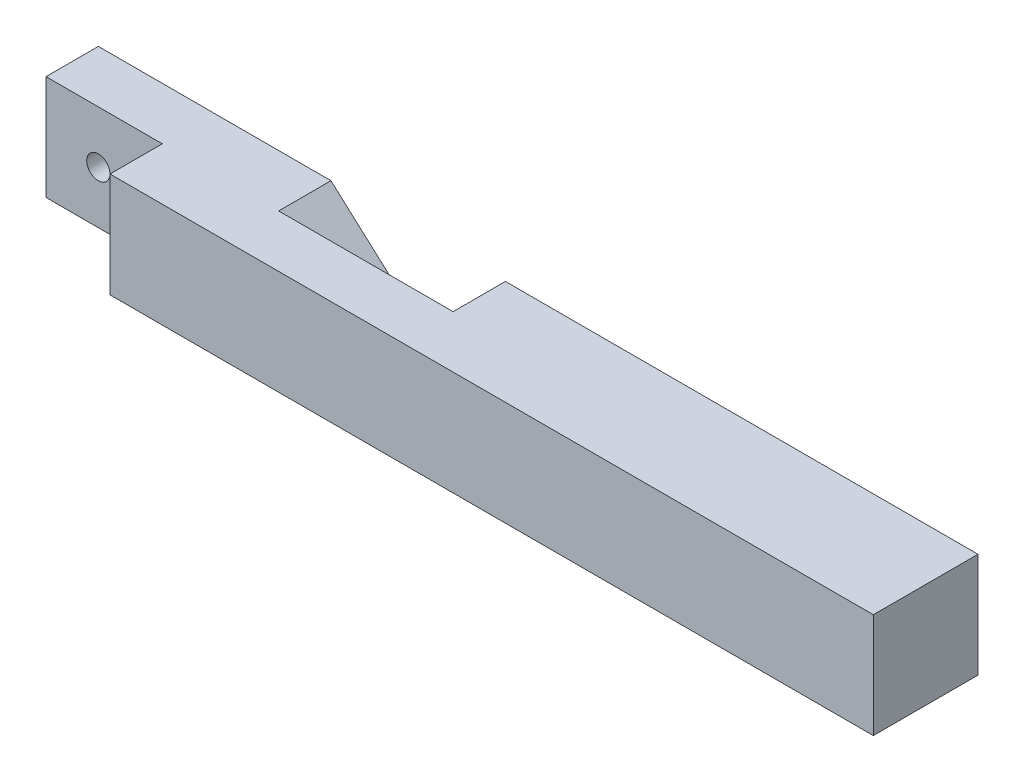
ISO-10303-21;
HEADER;
FILE_DESCRIPTION(('STEP AP214'),'2;1');
FILE_NAME('part.step','',(''),(''),'','','');
FILE_SCHEMA(('AUTOMOTIVE_DESIGN { 1 0 10303 214 1 1 1 1 }'));
ENDSEC;
DATA;
#1=APPLICATION_CONTEXT('core data for automotive mechanical design processes');
#2=APPLICATION_PROTOCOL_DEFINITION('international standard','automotive_design',2000,#1);
#3=PRODUCT_CONTEXT('',#1,'mechanical');
#4=PRODUCT('Part','Part','',(#3));
#5=PRODUCT_RELATED_PRODUCT_CATEGORY('part','',(#4));
#6=PRODUCT_DEFINITION_FORMATION('','',#4);
#7=PRODUCT_DEFINITION_CONTEXT('part definition',#1,'design');
#8=PRODUCT_DEFINITION('design','',#6,#7);
#9=PRODUCT_DEFINITION_SHAPE('','',#8);
#10=(LENGTH_UNIT() NAMED_UNIT(*) SI_UNIT(.MILLI.,.METRE.));
#11=(NAMED_UNIT(*) PLANE_ANGLE_UNIT() SI_UNIT($,.RADIAN.));
#12=(NAMED_UNIT(*) SI_UNIT($,.STERADIAN.) SOLID_ANGLE_UNIT());
#13=UNCERTAINTY_MEASURE_WITH_UNIT(LENGTH_MEASURE(1.E-05),#10,'distance_accuracy_value','');
#14=(GEOMETRIC_REPRESENTATION_CONTEXT(3) GLOBAL_UNCERTAINTY_ASSIGNED_CONTEXT((#13)) GLOBAL_UNIT_ASSIGNED_CONTEXT((#10,
#11,#12)) REPRESENTATION_CONTEXT('',''));
#15=CARTESIAN_POINT('',(0.,0.,0.));
#16=DIRECTION('',(0.,0.,1.));
#17=DIRECTION('',(1.,0.,0.));
#18=AXIS2_PLACEMENT_3D('',#15,#16,#17);
#19=CARTESIAN_POINT('',(0.,9.,0.));
#20=DIRECTION('',(0.,0.,-1.));
#21=DIRECTION('',(-1.,0.,0.));
#22=AXIS2_PLACEMENT_3D('',#19,#20,#21);
#23=PLANE('',#22);
#24=DIRECTION('',(-0.743294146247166,-0.66896473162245,0.));
#25=VECTOR('',#24,1.);
#26=CARTESIAN_POINT('',(35.,0.,0.));
#27=LINE('',#26,#25);
#28=CARTESIAN_POINT('',(40.,4.5,0.));
#29=VERTEX_POINT('',#28);
#30=CARTESIAN_POINT('',(35.,0.,0.));
#31=VERTEX_POINT('',#30);
#32=EDGE_CURVE('E140',#29,#31,#27,.T.);
#33=ORIENTED_EDGE('',*,*,#32,.F.);
#34=DIRECTION('',(0.743294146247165,-0.668964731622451,0.));
#35=VECTOR('',#34,1.);
#36=CARTESIAN_POINT('',(40.,4.5,0.));
#37=LINE('',#36,#35);
#38=CARTESIAN_POINT('',(35.,9.,0.));
#39=VERTEX_POINT('',#38);
#40=EDGE_CURVE('E142',#39,#29,#37,.T.);
#41=ORIENTED_EDGE('',*,*,#40,.F.);
#42=DIRECTION('',(-1.,0.,0.));
#43=VECTOR('',#42,1.);
#44=CARTESIAN_POINT('',(0.,9.,0.));
#45=LINE('',#44,#43);
#46=CARTESIAN_POINT('',(75.63,9.,0.));
#47=VERTEX_POINT('',#46);
#48=EDGE_CURVE('E193',#47,#39,#45,.T.);
#49=ORIENTED_EDGE('',*,*,#48,.F.);
#50=DIRECTION('',(0.,1.,0.));
#51=VECTOR('',#50,1.);
#52=CARTESIAN_POINT('',(75.63,0.,0.));
#53=LINE('',#52,#51);
#54=CARTESIAN_POINT('',(75.63,0.,0.));
#55=VERTEX_POINT('',#54);
#56=EDGE_CURVE('E205',#55,#47,#53,.T.);
#57=ORIENTED_EDGE('',*,*,#56,.F.);
#58=DIRECTION('',(1.,0.,0.));
#59=VECTOR('',#58,1.);
#60=CARTESIAN_POINT('',(0.,0.,0.));
#61=LINE('',#60,#59);
#62=EDGE_CURVE('E201',#31,#55,#61,.T.);
#63=ORIENTED_EDGE('',*,*,#62,.F.);
#64=EDGE_LOOP('',(#33,#41,#49,#57,#63));
#65=FACE_BOUND('',#64,.T.);
#66=ADVANCED_FACE('F31',(#65),#23,.T.);
#67=CARTESIAN_POINT('',(0.,0.,9.));
#68=DIRECTION('',(1.,0.,0.));
#69=DIRECTION('',(0.,0.,-1.));
#70=AXIS2_PLACEMENT_3D('',#67,#68,#69);
#71=PLANE('',#70);
#72=DIRECTION('',(0.,-1.,0.));
#73=VECTOR('',#72,1.);
#74=CARTESIAN_POINT('',(0.,9.,4.5));
#75=LINE('',#74,#73);
#76=CARTESIAN_POINT('',(0.,9.,4.5));
#77=VERTEX_POINT('',#76);
#78=CARTESIAN_POINT('',(0.,0.,4.5));
#79=VERTEX_POINT('',#78);
#80=EDGE_CURVE('E174',#77,#79,#75,.T.);
#81=ORIENTED_EDGE('',*,*,#80,.F.);
#82=DIRECTION('',(0.,0.,-1.));
#83=VECTOR('',#82,1.);
#84=CARTESIAN_POINT('',(0.,9.,9.));
#85=LINE('',#84,#83);
#86=CARTESIAN_POINT('',(0.,9.,0.));
#87=VERTEX_POINT('',#86);
#88=EDGE_CURVE('E198',#77,#87,#85,.T.);
#89=ORIENTED_EDGE('',*,*,#88,.T.);
#90=DIRECTION('',(0.,-1.,0.));
#91=VECTOR('',#90,1.);
#92=CARTESIAN_POINT('',(0.,0.,0.));
#93=LINE('',#92,#91);
#94=CARTESIAN_POINT('',(0.,0.,0.));
#95=VERTEX_POINT('',#94);
#96=EDGE_CURVE('E188',#87,#95,#93,.T.);
#97=ORIENTED_EDGE('',*,*,#96,.T.);
#98=DIRECTION('',(0.,0.,-1.));
#99=VECTOR('',#98,1.);
#100=CARTESIAN_POINT('',(0.,0.,9.));
#101=LINE('',#100,#99);
#102=EDGE_CURVE('E11',#79,#95,#101,.T.);
#103=ORIENTED_EDGE('',*,*,#102,.F.);
#104=EDGE_LOOP('',(#81,#89,#97,#103));
#105=FACE_BOUND('',#104,.T.);
#106=ADVANCED_FACE('F33',(#105),#71,.F.);
#107=CARTESIAN_POINT('',(0.,0.,9.));
#108=DIRECTION('',(0.,1.,0.));
#109=DIRECTION('',(0.,0.,1.));
#110=AXIS2_PLACEMENT_3D('',#107,#108,#109);
#111=PLANE('',#110);
#112=CARTESIAN_POINT('',(20.,0.,0.));
#113=VERTEX_POINT('',#112);
#114=EDGE_CURVE('E202',#95,#113,#61,.T.);
#115=ORIENTED_EDGE('',*,*,#114,.T.);
#116=DIRECTION('',(0.,0.,-1.));
#117=VECTOR('',#116,1.);
#118=CARTESIAN_POINT('',(20.,0.,4.5));
#119=LINE('',#118,#117);
#120=CARTESIAN_POINT('',(20.,0.,4.5));
#121=VERTEX_POINT('',#120);
#122=EDGE_CURVE('E157',#121,#113,#119,.T.);
#123=ORIENTED_EDGE('',*,*,#122,.F.);
#124=DIRECTION('',(-1.,0.,0.));
#125=VECTOR('',#124,1.);
#126=CARTESIAN_POINT('',(20.,0.,4.5));
#127=LINE('',#126,#125);
#128=CARTESIAN_POINT('',(35.,0.,4.5));
#129=VERTEX_POINT('',#128);
#130=EDGE_CURVE('E125',#129,#121,#127,.T.);
#131=ORIENTED_EDGE('',*,*,#130,.F.);
#132=DIRECTION('',(0.,0.,-1.));
#133=VECTOR('',#132,1.);
#134=CARTESIAN_POINT('',(35.,0.,4.5));
#135=LINE('',#134,#133);
#136=EDGE_CURVE('E160',#129,#31,#135,.T.);
#137=ORIENTED_EDGE('',*,*,#136,.T.);
#138=ORIENTED_EDGE('',*,*,#62,.T.);
#139=DIRECTION('',(0.,0.,-1.));
#140=VECTOR('',#139,1.);
#141=CARTESIAN_POINT('',(75.63,0.,9.));
#142=LINE('',#141,#140);
#143=CARTESIAN_POINT('',(75.63,0.,9.));
#144=VERTEX_POINT('',#143);
#145=EDGE_CURVE('E39',#144,#55,#142,.T.);
#146=ORIENTED_EDGE('',*,*,#145,.F.);
#147=DIRECTION('',(1.,0.,0.));
#148=VECTOR('',#147,1.);
#149=CARTESIAN_POINT('',(0.,0.,9.));
#150=LINE('',#149,#148);
#151=CARTESIAN_POINT('',(10.,0.,9.));
#152=VERTEX_POINT('',#151);
#153=EDGE_CURVE('E190',#152,#144,#150,.T.);
#154=ORIENTED_EDGE('',*,*,#153,.F.);
#155=DIRECTION('',(0.,0.,1.));
#156=VECTOR('',#155,1.);
#157=CARTESIAN_POINT('',(10.,0.,4.5));
#158=LINE('',#157,#156);
#159=CARTESIAN_POINT('',(10.,0.,4.5));
#160=VERTEX_POINT('',#159);
#161=EDGE_CURVE('E54',#160,#152,#158,.T.);
#162=ORIENTED_EDGE('',*,*,#161,.F.);
#163=DIRECTION('',(1.,0.,0.));
#164=VECTOR('',#163,1.);
#165=CARTESIAN_POINT('',(0.,0.,4.5));
#166=LINE('',#165,#164);
#167=EDGE_CURVE('E176',#79,#160,#166,.T.);
#168=ORIENTED_EDGE('',*,*,#167,.F.);
#169=ORIENTED_EDGE('',*,*,#102,.T.);
#170=EDGE_LOOP('',(#115,#123,#131,#137,#138,#146,#154,#162,#168,#169));
#171=FACE_BOUND('',#170,.T.);
#172=ADVANCED_FACE('F235',(#171),#111,.F.);
#173=CARTESIAN_POINT('',(75.63,0.,9.));
#174=DIRECTION('',(-1.,0.,0.));
#175=DIRECTION('',(0.,0.,1.));
#176=AXIS2_PLACEMENT_3D('',#173,#174,#175);
#177=PLANE('',#176);
#178=ORIENTED_EDGE('',*,*,#56,.T.);
#179=DIRECTION('',(0.,0.,-1.));
#180=VECTOR('',#179,1.);
#181=CARTESIAN_POINT('',(75.63,9.,9.));
#182=LINE('',#181,#180);
#183=CARTESIAN_POINT('',(75.63,9.,9.));
#184=VERTEX_POINT('',#183);
#185=EDGE_CURVE('E212',#184,#47,#182,.T.);
#186=ORIENTED_EDGE('',*,*,#185,.F.);
#187=DIRECTION('',(0.,1.,0.));
#188=VECTOR('',#187,1.);
#189=CARTESIAN_POINT('',(75.63,0.,9.));
#190=LINE('',#189,#188);
#191=EDGE_CURVE('E192',#144,#184,#190,.T.);
#192=ORIENTED_EDGE('',*,*,#191,.F.);
#193=ORIENTED_EDGE('',*,*,#145,.T.);
#194=EDGE_LOOP('',(#178,#186,#192,#193));
#195=FACE_BOUND('',#194,.T.);
#196=ADVANCED_FACE('F219',(#195),#177,.F.);
#197=CARTESIAN_POINT('',(0.,9.,9.));
#198=DIRECTION('',(0.,-1.,0.));
#199=DIRECTION('',(0.,0.,-1.));
#200=AXIS2_PLACEMENT_3D('',#197,#198,#199);
#201=PLANE('',#200);
#202=ORIENTED_EDGE('',*,*,#48,.T.);
#203=DIRECTION('',(0.,0.,-1.));
#204=VECTOR('',#203,1.);
#205=CARTESIAN_POINT('',(35.,9.,4.5));
#206=LINE('',#205,#204);
#207=CARTESIAN_POINT('',(35.,9.,4.5));
#208=VERTEX_POINT('',#207);
#209=EDGE_CURVE('E165',#208,#39,#206,.T.);
#210=ORIENTED_EDGE('',*,*,#209,.F.);
#211=DIRECTION('',(1.,0.,0.));
#212=VECTOR('',#211,1.);
#213=CARTESIAN_POINT('',(35.,9.,4.5));
#214=LINE('',#213,#212);
#215=CARTESIAN_POINT('',(20.,9.,4.5));
#216=VERTEX_POINT('',#215);
#217=EDGE_CURVE('E134',#216,#208,#214,.T.);
#218=ORIENTED_EDGE('',*,*,#217,.F.);
#219=DIRECTION('',(0.,0.,-1.));
#220=VECTOR('',#219,1.);
#221=CARTESIAN_POINT('',(20.,9.,4.5));
#222=LINE('',#221,#220);
#223=CARTESIAN_POINT('',(20.,9.,0.));
#224=VERTEX_POINT('',#223);
#225=EDGE_CURVE('E124',#216,#224,#222,.T.);
#226=ORIENTED_EDGE('',*,*,#225,.T.);
#227=EDGE_CURVE('E207',#224,#87,#45,.T.);
#228=ORIENTED_EDGE('',*,*,#227,.T.);
#229=ORIENTED_EDGE('',*,*,#88,.F.);
#230=DIRECTION('',(-1.,0.,0.));
#231=VECTOR('',#230,1.);
#232=CARTESIAN_POINT('',(0.,9.,4.5));
#233=LINE('',#232,#231);
#234=CARTESIAN_POINT('',(10.,9.,4.5));
#235=VERTEX_POINT('',#234);
#236=EDGE_CURVE('E182',#235,#77,#233,.T.);
#237=ORIENTED_EDGE('',*,*,#236,.F.);
#238=DIRECTION('',(0.,0.,1.));
#239=VECTOR('',#238,1.);
#240=CARTESIAN_POINT('',(10.,9.,4.5));
#241=LINE('',#240,#239);
#242=CARTESIAN_POINT('',(10.,9.,9.));
#243=VERTEX_POINT('',#242);
#244=EDGE_CURVE('E185',#235,#243,#241,.T.);
#245=ORIENTED_EDGE('',*,*,#244,.T.);
#246=DIRECTION('',(-1.,0.,0.));
#247=VECTOR('',#246,1.);
#248=CARTESIAN_POINT('',(0.,9.,9.));
#249=LINE('',#248,#247);
#250=EDGE_CURVE('E195',#184,#243,#249,.T.);
#251=ORIENTED_EDGE('',*,*,#250,.F.);
#252=ORIENTED_EDGE('',*,*,#185,.T.);
#253=EDGE_LOOP('',(#202,#210,#218,#226,#228,#229,#237,#245,#251,#252));
#254=FACE_BOUND('',#253,.T.);
#255=ADVANCED_FACE('F230',(#254),#201,.F.);
#256=CARTESIAN_POINT('',(0.,9.,9.));
#257=DIRECTION('',(0.,0.,-1.));
#258=DIRECTION('',(-1.,0.,0.));
#259=AXIS2_PLACEMENT_3D('',#256,#257,#258);
#260=PLANE('',#259);
#261=ORIENTED_EDGE('',*,*,#250,.T.);
#262=DIRECTION('',(0.,1.,0.));
#263=VECTOR('',#262,1.);
#264=CARTESIAN_POINT('',(10.,9.,9.));
#265=LINE('',#264,#263);
#266=EDGE_CURVE('E171',#152,#243,#265,.T.);
#267=ORIENTED_EDGE('',*,*,#266,.F.);
#268=ORIENTED_EDGE('',*,*,#153,.T.);
#269=ORIENTED_EDGE('',*,*,#191,.T.);
#270=EDGE_LOOP('',(#261,#267,#268,#269));
#271=FACE_BOUND('',#270,.T.);
#272=ADVANCED_FACE('F234',(#271),#260,.F.);
#273=DIRECTION('',(0.743294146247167,0.668964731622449,0.));
#274=VECTOR('',#273,1.);
#275=CARTESIAN_POINT('',(25.,4.5,0.));
#276=LINE('',#275,#274);
#277=CARTESIAN_POINT('',(25.,4.5,0.));
#278=VERTEX_POINT('',#277);
#279=EDGE_CURVE('E46',#113,#278,#276,.T.);
#280=ORIENTED_EDGE('',*,*,#279,.F.);
#281=ORIENTED_EDGE('',*,*,#114,.F.);
#282=ORIENTED_EDGE('',*,*,#96,.F.);
#283=ORIENTED_EDGE('',*,*,#227,.F.);
#284=DIRECTION('',(-0.743294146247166,0.66896473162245,0.));
#285=VECTOR('',#284,1.);
#286=CARTESIAN_POINT('',(20.,9.,0.));
#287=LINE('',#286,#285);
#288=EDGE_CURVE('E153',#278,#224,#287,.T.);
#289=ORIENTED_EDGE('',*,*,#288,.F.);
#290=EDGE_LOOP('',(#280,#281,#282,#283,#289));
#291=FACE_BOUND('',#290,.T.);
#292=CARTESIAN_POINT('',(4.5,4.5,0.));
#293=DIRECTION('',(0.,0.,1.));
#294=DIRECTION('',(1.,0.,0.));
#295=AXIS2_PLACEMENT_3D('',#292,#293,#294);
#296=CIRCLE('',#295,1.);
#297=CARTESIAN_POINT('',(5.5,4.5,0.));
#298=VERTEX_POINT('',#297);
#299=EDGE_CURVE('E168',#298,#298,#296,.T.);
#300=ORIENTED_EDGE('',*,*,#299,.T.);
#301=EDGE_LOOP('',(#300));
#302=FACE_BOUND('',#301,.T.);
#303=ADVANCED_FACE('F246',(#291,#302),#23,.T.);
#304=CARTESIAN_POINT('',(10.,9.,4.5));
#305=DIRECTION('',(1.,0.,0.));
#306=DIRECTION('',(0.,1.,0.));
#307=AXIS2_PLACEMENT_3D('',#304,#305,#306);
#308=PLANE('',#307);
#309=ORIENTED_EDGE('',*,*,#266,.T.);
#310=ORIENTED_EDGE('',*,*,#244,.F.);
#311=DIRECTION('',(0.,1.,0.));
#312=VECTOR('',#311,1.);
#313=CARTESIAN_POINT('',(10.,9.,4.5));
#314=LINE('',#313,#312);
#315=EDGE_CURVE('E179',#160,#235,#314,.T.);
#316=ORIENTED_EDGE('',*,*,#315,.F.);
#317=ORIENTED_EDGE('',*,*,#161,.T.);
#318=EDGE_LOOP('',(#309,#310,#316,#317));
#319=FACE_BOUND('',#318,.T.);
#320=ADVANCED_FACE('F269',(#319),#308,.F.);
#321=CARTESIAN_POINT('',(0.,0.,4.5));
#322=DIRECTION('',(0.,0.,1.));
#323=DIRECTION('',(1.,0.,0.));
#324=AXIS2_PLACEMENT_3D('',#321,#322,#323);
#325=PLANE('',#324);
#326=CARTESIAN_POINT('',(4.5,4.5,4.5));
#327=DIRECTION('',(0.,0.,1.));
#328=DIRECTION('',(1.,0.,0.));
#329=AXIS2_PLACEMENT_3D('',#326,#327,#328);
#330=CIRCLE('',#329,1.);
#331=CARTESIAN_POINT('',(5.5,4.5,4.5));
#332=VERTEX_POINT('',#331);
#333=EDGE_CURVE('E159',#332,#332,#330,.T.);
#334=ORIENTED_EDGE('',*,*,#333,.F.);
#335=EDGE_LOOP('',(#334));
#336=FACE_BOUND('',#335,.T.);
#337=ORIENTED_EDGE('',*,*,#80,.T.);
#338=ORIENTED_EDGE('',*,*,#167,.T.);
#339=ORIENTED_EDGE('',*,*,#315,.T.);
#340=ORIENTED_EDGE('',*,*,#236,.T.);
#341=EDGE_LOOP('',(#337,#338,#339,#340));
#342=FACE_BOUND('',#341,.T.);
#343=ADVANCED_FACE('F274',(#336,#342),#325,.T.);
#344=CARTESIAN_POINT('',(4.5,4.5,0.));
#345=DIRECTION('',(0.,0.,1.));
#346=DIRECTION('',(1.,0.,0.));
#347=AXIS2_PLACEMENT_3D('',#344,#345,#346);
#348=CYLINDRICAL_SURFACE('',#347,1.);
#349=ORIENTED_EDGE('',*,*,#299,.F.);
#350=EDGE_LOOP('',(#349));
#351=FACE_BOUND('',#350,.T.);
#352=ORIENTED_EDGE('',*,*,#333,.T.);
#353=EDGE_LOOP('',(#352));
#354=FACE_BOUND('',#353,.T.);
#355=ADVANCED_FACE('F282',(#351,#354),#348,.F.);
#356=CARTESIAN_POINT('',(25.,4.5,4.5));
#357=DIRECTION('',(-0.668964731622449,0.743294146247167,0.));
#358=DIRECTION('',(-0.743294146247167,-0.668964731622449,0.));
#359=AXIS2_PLACEMENT_3D('',#356,#357,#358);
#360=PLANE('',#359);
#361=ORIENTED_EDGE('',*,*,#279,.T.);
#362=DIRECTION('',(0.,0.,-1.));
#363=VECTOR('',#362,1.);
#364=CARTESIAN_POINT('',(25.,4.5,4.5));
#365=LINE('',#364,#363);
#366=CARTESIAN_POINT('',(25.,4.5,4.5));
#367=VERTEX_POINT('',#366);
#368=EDGE_CURVE('E116',#367,#278,#365,.T.);
#369=ORIENTED_EDGE('',*,*,#368,.F.);
#370=DIRECTION('',(0.743294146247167,0.668964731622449,0.));
#371=VECTOR('',#370,1.);
#372=CARTESIAN_POINT('',(25.,4.5,4.5));
#373=LINE('',#372,#371);
#374=EDGE_CURVE('E120',#121,#367,#373,.T.);
#375=ORIENTED_EDGE('',*,*,#374,.F.);
#376=ORIENTED_EDGE('',*,*,#122,.T.);
#377=EDGE_LOOP('',(#361,#369,#375,#376));
#378=FACE_BOUND('',#377,.T.);
#379=ADVANCED_FACE('F118',(#378),#360,.F.);
#380=CARTESIAN_POINT('',(35.,0.,4.5));
#381=DIRECTION('',(0.66896473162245,-0.743294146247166,0.));
#382=DIRECTION('',(0.743294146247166,0.66896473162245,0.));
#383=AXIS2_PLACEMENT_3D('',#380,#381,#382);
#384=PLANE('',#383);
#385=ORIENTED_EDGE('',*,*,#32,.T.);
#386=ORIENTED_EDGE('',*,*,#136,.F.);
#387=DIRECTION('',(-0.743294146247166,-0.66896473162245,0.));
#388=VECTOR('',#387,1.);
#389=CARTESIAN_POINT('',(35.,0.,4.5));
#390=LINE('',#389,#388);
#391=CARTESIAN_POINT('',(40.,4.5,4.5));
#392=VERTEX_POINT('',#391);
#393=EDGE_CURVE('E149',#392,#129,#390,.T.);
#394=ORIENTED_EDGE('',*,*,#393,.F.);
#395=DIRECTION('',(0.,0.,-1.));
#396=VECTOR('',#395,1.);
#397=CARTESIAN_POINT('',(40.,4.5,4.5));
#398=LINE('',#397,#396);
#399=EDGE_CURVE('E163',#392,#29,#398,.T.);
#400=ORIENTED_EDGE('',*,*,#399,.T.);
#401=EDGE_LOOP('',(#385,#386,#394,#400));
#402=FACE_BOUND('',#401,.T.);
#403=ADVANCED_FACE('F250',(#402),#384,.F.);
#404=CARTESIAN_POINT('',(40.,4.5,4.5));
#405=DIRECTION('',(0.668964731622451,0.743294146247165,0.));
#406=DIRECTION('',(-0.743294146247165,0.668964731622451,0.));
#407=AXIS2_PLACEMENT_3D('',#404,#405,#406);
#408=PLANE('',#407);
#409=ORIENTED_EDGE('',*,*,#40,.T.);
#410=ORIENTED_EDGE('',*,*,#399,.F.);
#411=DIRECTION('',(0.743294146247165,-0.668964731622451,0.));
#412=VECTOR('',#411,1.);
#413=CARTESIAN_POINT('',(40.,4.5,4.5));
#414=LINE('',#413,#412);
#415=EDGE_CURVE('E146',#208,#392,#414,.T.);
#416=ORIENTED_EDGE('',*,*,#415,.F.);
#417=ORIENTED_EDGE('',*,*,#209,.T.);
#418=EDGE_LOOP('',(#409,#410,#416,#417));
#419=FACE_BOUND('',#418,.T.);
#420=ADVANCED_FACE('F252',(#419),#408,.F.);
#421=CARTESIAN_POINT('',(20.,9.,4.5));
#422=DIRECTION('',(-0.66896473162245,-0.743294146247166,0.));
#423=DIRECTION('',(0.743294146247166,-0.66896473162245,0.));
#424=AXIS2_PLACEMENT_3D('',#421,#422,#423);
#425=PLANE('',#424);
#426=ORIENTED_EDGE('',*,*,#288,.T.);
#427=ORIENTED_EDGE('',*,*,#225,.F.);
#428=DIRECTION('',(-0.743294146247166,0.66896473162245,0.));
#429=VECTOR('',#428,1.);
#430=CARTESIAN_POINT('',(20.,9.,4.5));
#431=LINE('',#430,#429);
#432=EDGE_CURVE('E128',#367,#216,#431,.T.);
#433=ORIENTED_EDGE('',*,*,#432,.F.);
#434=ORIENTED_EDGE('',*,*,#368,.T.);
#435=EDGE_LOOP('',(#426,#427,#433,#434));
#436=FACE_BOUND('',#435,.T.);
#437=ADVANCED_FACE('F129',(#436),#425,.F.);
#438=CARTESIAN_POINT('',(32.5,11.25,4.5));
#439=DIRECTION('',(0.,0.,-1.));
#440=DIRECTION('',(-1.,0.,0.));
#441=AXIS2_PLACEMENT_3D('',#438,#439,#440);
#442=PLANE('',#441);
#443=ORIENTED_EDGE('',*,*,#374,.T.);
#444=ORIENTED_EDGE('',*,*,#432,.T.);
#445=ORIENTED_EDGE('',*,*,#217,.T.);
#446=ORIENTED_EDGE('',*,*,#415,.T.);
#447=ORIENTED_EDGE('',*,*,#393,.T.);
#448=ORIENTED_EDGE('',*,*,#130,.T.);
#449=EDGE_LOOP('',(#443,#444,#445,#446,#447,#448));
#450=FACE_BOUND('',#449,.T.);
#451=ADVANCED_FACE('F136',(#450),#442,.T.);
#452=CLOSED_SHELL('',(#66,#106,#172,#196,#255,#272,#303,#320,#343,#355,#379,#403,#420,#437,#451));
#453=MANIFOLD_SOLID_BREP('B2',#452);
#454=ADVANCED_BREP_SHAPE_REPRESENTATION('',(#18,#453),#14);
#455=SHAPE_DEFINITION_REPRESENTATION(#9,#454);
ENDSEC;
END-ISO-10303-21;
